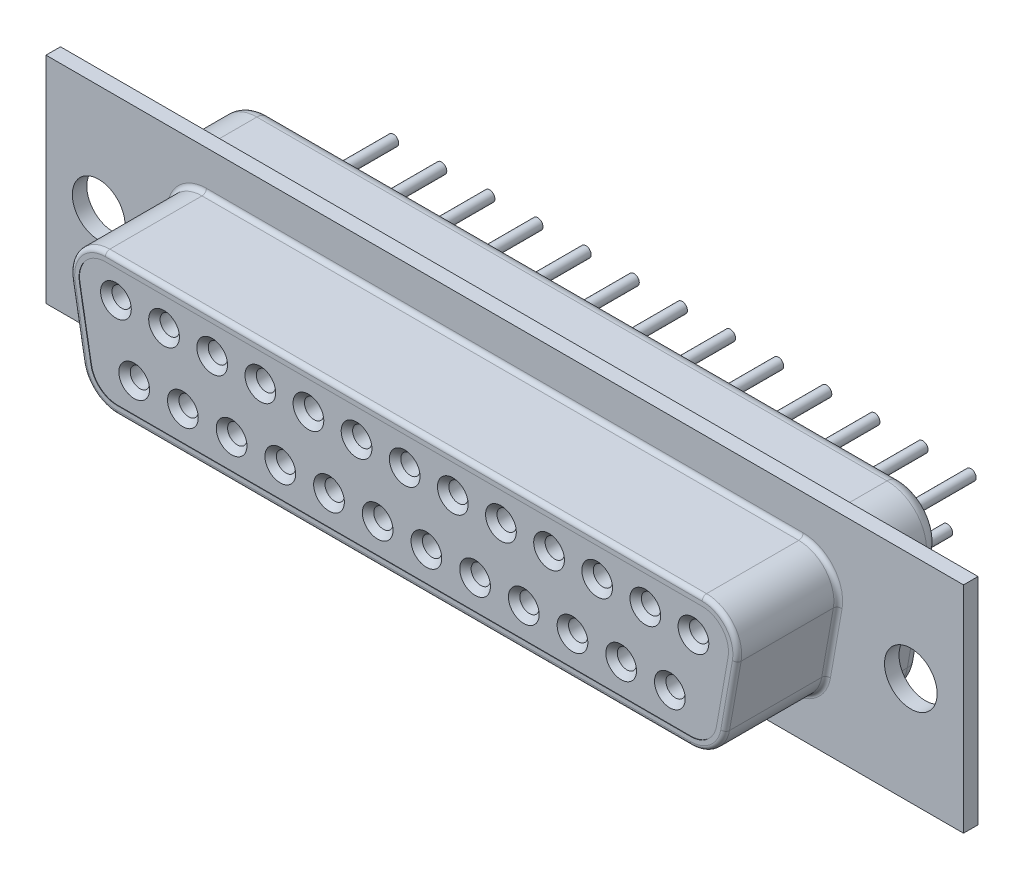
from build123d import *

# Parameters (mm, degrees)
SKETCH1_W                                         = 53.086
SKETCH1_H                                         = 12.446
EXTRUDE1_DEPTH                                    = 0.4191
EXTRUDE2_DEPTH                                    = 5.842
CUT_EXTRUDE1_DEPTH                                = 0.0254
FILLET1_R                                         = 0.254
CSK_FOR_4_FLAT_HEAD_MACHINE_SCREW_100_D           = 1.1176
CSK_FOR_4_FLAT_HEAD_MACHINE_SCREW_100_DEPTH       = 5.8166
CSK_FOR_4_FLAT_HEAD_MACHINE_SCREW_100_CSINK_D     = 1.778
CSK_FOR_4_FLAT_HEAD_MACHINE_SCREW_100_CSINK_ANGLE = 90
EXTRUDE3_DEPTH                                    = 3.81
EXTRUDE4_DEPTH                                    = 1.016
SKETCH9_R                                         = 0.3048
EXTRUDE5_DEPTH                                    = 4.572
FILLET2_R                                         = 0.762
CUT_EXTRUDE4_DEPTH                                = 29.976404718
CUT_EXTRUDE4_DEPTH_BACK                           = 29.976404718
SKETCH10_R                                        = 1.524


with BuildPart() as part:
    # Sketch1 → Extrude1 (new, symmetric)
    with BuildSketch(Plane.XY):
        Rectangle(SKETCH1_W, SKETCH1_H)
    extrude(amount=EXTRUDE1_DEPTH, both=True)

    # Sketch2 → Extrude2 (add)
    with BuildSketch(Plane.XY.offset(0.4191)):
        with BuildLine():
            Line((17.2633567, 3.937), (-17.2633567, 3.937))
            ThreePointArc((-17.2633567, 3.937), (-18.819959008, 3.211144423), (-19.264486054, 1.552146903))
            Line((-19.264486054, 1.552146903), (-18.592680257, -2.257853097))
            ThreePointArc((-18.592680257, -2.257853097), (-17.897695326, -3.461602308), (-16.591550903, -3.937))
            Line((-16.591550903, -3.937), (16.591550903, -3.937))
            ThreePointArc((16.591550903, -3.937), (17.897695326, -3.461602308), (18.592680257, -2.257853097))
            Line((18.592680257, -2.257853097), (19.264486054, 1.552146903))
            ThreePointArc((19.264486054, 1.552146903), (18.819959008, 3.211144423), (17.2633567, 3.937))
        make_face()
    extrude(amount=EXTRUDE2_DEPTH)

    # Sketch3 → Cut-Extrude1 (cut)
    with BuildSketch(Plane.XY.offset(6.2611)):
        with BuildLine():
            Line((-18.764203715, 1.640360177), (-18.092397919, -2.169639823))
            ThreePointArc((-18.092397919, -2.169639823), (-17.571159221, -3.072451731), (-16.591550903, -3.429))
            Line((-16.591550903, -3.429), (16.591550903, -3.429))
            ThreePointArc((16.591550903, -3.429), (17.571159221, -3.072451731), (18.092397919, -2.169639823))
            Line((18.092397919, -2.169639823), (18.764203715, 1.640360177))
            ThreePointArc((18.764203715, 1.640360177), (18.430808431, 2.884608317), (17.2633567, 3.429))
            Line((17.2633567, 3.429), (-17.2633567, 3.429))
            ThreePointArc((-17.2633567, 3.429), (-18.430808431, 2.884608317), (-18.764203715, 1.640360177))
        make_face()
    extrude(amount=-CUT_EXTRUDE1_DEPTH, mode=Mode.SUBTRACT)

    # Fillet1
    fillet1_edges = [part.edges().sort_by_distance(p)[0] for p in [
        (-18.819959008, 3.211144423, 0.4191),
        (-18.928583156, -0.352853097, 0.4191),
        (-17.897695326, -3.461602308, 0.4191),
        (0, -3.937, 0.4191),
        (17.897695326, -3.461602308, 0.4191),
        (18.928583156, -0.352853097, 0.4191),
        (18.819959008, 3.211144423, 0.4191),
        (0, 3.937, 0.4191),
        (-18.819959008, 3.211144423, 6.2611),
        (-18.928583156, -0.352853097, 6.2611),
        (-17.897695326, -3.461602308, 6.2611),
        (0, -3.937, 6.2611),
        (17.897695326, -3.461602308, 6.2611),
        (18.928583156, -0.352853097, 6.2611),
        (18.819959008, 3.211144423, 6.2611),
        (0, 3.937, 6.2611),
    ]]
    fillet(fillet1_edges, radius=FILLET1_R)

    # CSK for _4 Flat Head Machine Screw _100
    with Locations(Plane.XY.offset(6.2357)):
        with Locations((16.734190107, 1.720835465), (13.949645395, 1.725407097), (11.165100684, 1.729978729), (8.380555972, 1.734550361), (5.596011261, 1.739121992), (2.811466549, 1.743693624), (0.026921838, 1.748265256), (-2.757622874, 1.752836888), (-5.542167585, 1.75740852), (-8.326712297, 1.761980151), (-11.111257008, 1.766551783), (-13.89580172, 1.771123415), (-16.680346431, 1.775695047), (-15.623692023, -1.728986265), (-12.806035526, -1.728986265), (-9.98837903, -1.728986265), (-7.170722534, -1.728986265), (-4.353066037, -1.728986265), (-1.535409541, -1.728986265), (1.282246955, -1.728986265), (4.099903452, -1.728986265), (6.917559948, -1.728986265), (9.735216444, -1.728986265), (12.552872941, -1.728986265), (15.370529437, -1.728986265)):
            CounterSinkHole(CSK_FOR_4_FLAT_HEAD_MACHINE_SCREW_100_D / 2, CSK_FOR_4_FLAT_HEAD_MACHINE_SCREW_100_CSINK_D / 2, depth=CSK_FOR_4_FLAT_HEAD_MACHINE_SCREW_100_DEPTH, counter_sink_angle=CSK_FOR_4_FLAT_HEAD_MACHINE_SCREW_100_CSINK_ANGLE)

    # Sketch7 → Extrude3 (add)
    with BuildSketch(Plane(origin=(0, 0, -0.4191), x_dir=(-1, 0, 0), z_dir=(0, 0, -1))):
        with BuildLine():
            Line((-18.230651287, 5.334), (18.230651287, 5.334))
            ThreePointArc((18.230651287, 5.334), (19.981828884, 4.517412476), (20.481921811, 2.651040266))
            Line((20.481921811, 2.651040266), (19.407032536, -3.444959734))
            ThreePointArc((19.407032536, -3.444959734), (18.625174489, -4.799177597), (17.155762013, -5.334))
            Line((17.155762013, -5.334), (-17.155762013, -5.334))
            ThreePointArc((-17.155762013, -5.334), (-18.625174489, -4.799177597), (-19.407032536, -3.444959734))
            Line((-19.407032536, -3.444959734), (-20.481921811, 2.651040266))
            ThreePointArc((-20.481921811, 2.651040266), (-19.981828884, 4.517412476), (-18.230651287, 5.334))
        make_face()
    extrude(amount=EXTRUDE3_DEPTH)

    # Sketch8 → Extrude4 (add)
    with BuildSketch(Plane(origin=(0, 0, -4.2291), x_dir=(-1, 0, 0), z_dir=(0, 0, -1))):
        with BuildLine():
            Line((-18.369323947, 1.640360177), (-17.69751815, -2.169639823))
            ThreePointArc((-17.69751815, -2.169639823), (-17.176279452, -3.072451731), (-16.196671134, -3.429))
            Line((-16.196671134, -3.429), (16.196671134, -3.429))
            ThreePointArc((16.196671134, -3.429), (17.176279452, -3.072451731), (17.69751815, -2.169639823))
            Line((17.69751815, -2.169639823), (18.369323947, 1.640360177))
            ThreePointArc((18.369323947, 1.640360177), (18.035928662, 2.884608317), (16.868476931, 3.429))
            Line((16.868476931, 3.429), (-16.868476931, 3.429))
            ThreePointArc((-16.868476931, 3.429), (-18.035928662, 2.884608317), (-18.369323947, 1.640360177))
        make_face()
    extrude(amount=EXTRUDE4_DEPTH)

    # Sketch9 → Extrude5 (add)
    with BuildSketch(Plane(origin=(0, 0, -5.2451), x_dir=(-1, 0, 0), z_dir=(0, 0, -1))):
        with Locations(Location((16.680346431, 1.775695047, 0), (0, 0, 180))):
            Circle(SKETCH9_R)
    extrude5 = extrude(amount=EXTRUDE5_DEPTH)

    # Sketch-Pattern2: Extrude5 at 24 more places
    with Locations((1.056654, -3.504681, 0), (3.874311, -3.504681, 0), (2.784545, -0.004572, 0), (5.569089, -0.009143, 0), (6.691967, -3.504681, 0), (9.509624, -3.504681, 0), (8.353634, -0.013715, 0), (11.138179, -0.018287, 0), (12.32728, -3.504681, 0), (15.144937, -3.504681, 0), (13.922724, -0.022858, 0), (16.707268, -0.02743, 0), (19.491813, -0.032001, 0), (22.276358, -0.036573, 0), (25.060902, -0.041145, 0), (27.845447, -0.045716, 0), (30.629992, -0.050288, 0), (33.414537, -0.05486, 0), (32.050876, -3.504681, 0), (29.233219, -3.504681, 0), (26.415563, -3.504681, 0), (23.597906, -3.504681, 0), (20.78025, -3.504681, 0), (17.962593, -3.504681, 0)):
        add(extrude5)

    # Fillet2
    fillet2_edges = [part.edges().sort_by_distance(p)[0] for p in [
        (19.981828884, 4.517412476, -0.4191),
        (19.944477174, -0.396959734, -0.4191),
        (18.625174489, -4.799177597, -0.4191),
        (0, -5.334, -0.4191),
        (-18.625174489, -4.799177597, -0.4191),
        (-19.944477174, -0.396959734, -0.4191),
        (-19.981828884, 4.517412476, -0.4191),
        (0, 5.334, -0.4191),
        (19.981828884, 4.517412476, -4.2291),
        (19.944477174, -0.396959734, -4.2291),
        (18.625174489, -4.799177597, -4.2291),
        (0, -5.334, -4.2291),
        (-18.625174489, -4.799177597, -4.2291),
        (-19.944477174, -0.396959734, -4.2291),
        (-19.981828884, 4.517412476, -4.2291),
        (0, 5.334, -4.2291),
    ]]
    fillet(fillet2_edges, radius=FILLET2_R)

    # Sketch10 → Cut-Extrude4 (cut, two sides: drawn at the far end of the back side and taken through both)
    with BuildSketch(Plane.XY.offset(-CUT_EXTRUDE4_DEPTH_BACK)):
        with Locations((23.495, 0)):
            Circle(SKETCH10_R)
        with Locations((-23.495, 0)):
            Circle(SKETCH10_R)
    extrude(amount=CUT_EXTRUDE4_DEPTH + CUT_EXTRUDE4_DEPTH_BACK, mode=Mode.SUBTRACT)


solid = part.part
